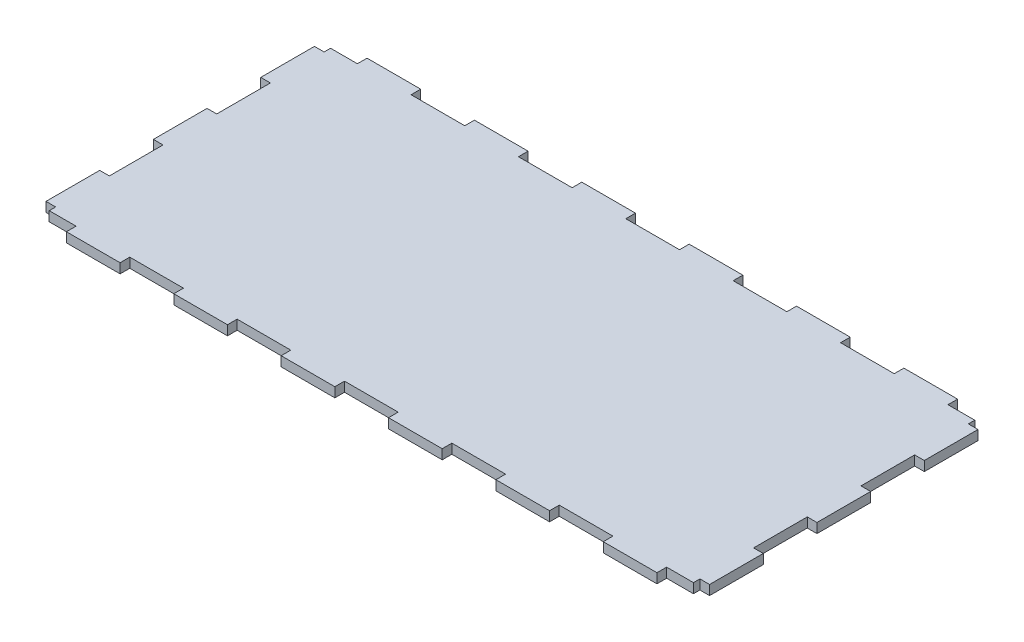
from build123d import *

# Parameters (mm, degrees)
BOSS_EXTRUDE1_DEPTH = 9


with BuildPart() as part:
    # Sketch1 → Boss-Extrude1 (new body)
    with BuildSketch(Plane(origin=(0, 0, 0), x_dir=(1, 0, 0), z_dir=(0, 1, 0))):
        Polygon((-275, -6), (-275, -15), (-225, -15), (-225, -6), (-175, -6), (-175, -15), (-125, -15), (-125, -6), (-75, -6), (-75, -15), (-25, -15), (-25, -6), (25, -6), (25, -15), (75, -15), (75, -6), (125, -6), (125, -15), (175, -15), (175, -6), (225, -6), (225, -15), (275, -15), (275, -6), (300, -6), (300, 0), (309, 0), (309, 50), (300, 50), (300, 100), (309, 100), (309, 150), (300, 150), (300, 200), (309, 200), (309, 250), (300, 250), (300, 256), (275, 256), (275, 265), (225, 265), (225, 256), (175, 256), (175, 265), (125, 265), (125, 256), (75, 256), (75, 265), (25, 265), (25, 256), (-25, 256), (-25, 265), (-75, 265), (-75, 256), (-125, 256), (-125, 265), (-175, 265), (-175, 256), (-225, 256), (-225, 265), (-275, 265), (-275, 256), (-300, 256), (-300, 250), (-309, 250), (-309, 200), (-300, 200), (-300, 150), (-309, 150), (-309, 100), (-300, 100), (-300, 50), (-309, 50), (-309, 0), (-300, 0), (-300, -6), align=None)
    extrude(amount=BOSS_EXTRUDE1_DEPTH)


solid = part.part
